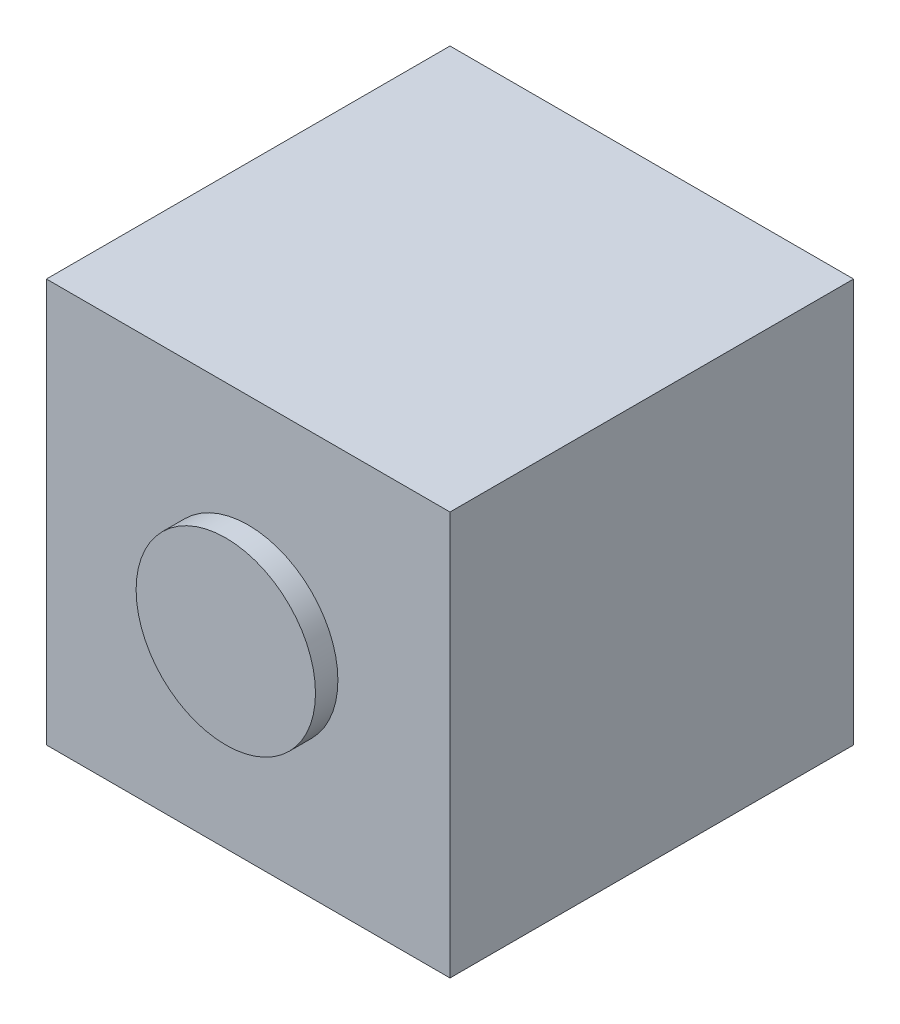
from build123d import *

# Parameters (mm, degrees)
SKETCH1_W           = 500
SKETCH1_H           = 500
BOSS_EXTRUDE1_DEPTH = 500
SCALE1_SCALE        = 0.09
SKETCH3_R           = 10
BOSS_EXTRUDE2_DEPTH = 2.5


with BuildPart() as part:
    # Sketch1 → Boss-Extrude1 (new body)
    with BuildSketch(Plane.XY):
        with Locations((250, 250)):
            Rectangle(SKETCH1_W, SKETCH1_H)
    extrude(amount=BOSS_EXTRUDE1_DEPTH)


with BuildPart() as part_1:
    # Scale1: scaled about (250, 250, 250)
    add(part.part.scale(SCALE1_SCALE).moved(Location((227.5, 227.5, 227.5))))

    # Sketch3 → Boss-Extrude2 (add)
    with BuildSketch(Plane.XY.offset(272.5)):
        with Locations((250, 250)):
            Circle(SKETCH3_R)
    extrude(amount=BOSS_EXTRUDE2_DEPTH)


solid = part_1.part
